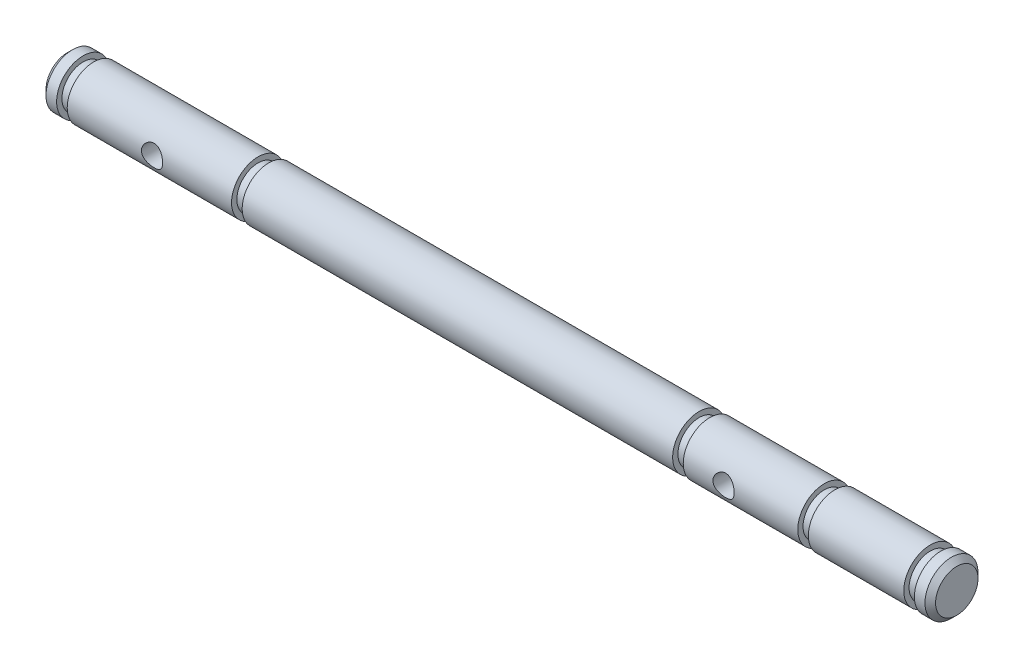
ISO-10303-21;
HEADER;
FILE_DESCRIPTION(('STEP AP214'),'2;1');
FILE_NAME('part.step','',(''),(''),'','','');
FILE_SCHEMA(('AUTOMOTIVE_DESIGN { 1 0 10303 214 1 1 1 1 }'));
ENDSEC;
DATA;
#1=APPLICATION_CONTEXT('core data for automotive mechanical design processes');
#2=APPLICATION_PROTOCOL_DEFINITION('international standard','automotive_design',2000,#1);
#3=PRODUCT_CONTEXT('',#1,'mechanical');
#4=PRODUCT('Part','Part','',(#3));
#5=PRODUCT_RELATED_PRODUCT_CATEGORY('part','',(#4));
#6=PRODUCT_DEFINITION_FORMATION('','',#4);
#7=PRODUCT_DEFINITION_CONTEXT('part definition',#1,'design');
#8=PRODUCT_DEFINITION('design','',#6,#7);
#9=PRODUCT_DEFINITION_SHAPE('','',#8);
#10=(LENGTH_UNIT() NAMED_UNIT(*) SI_UNIT(.MILLI.,.METRE.));
#11=(NAMED_UNIT(*) PLANE_ANGLE_UNIT() SI_UNIT($,.RADIAN.));
#12=(NAMED_UNIT(*) SI_UNIT($,.STERADIAN.) SOLID_ANGLE_UNIT());
#13=UNCERTAINTY_MEASURE_WITH_UNIT(LENGTH_MEASURE(1.E-05),#10,'distance_accuracy_value','');
#14=(GEOMETRIC_REPRESENTATION_CONTEXT(3) GLOBAL_UNCERTAINTY_ASSIGNED_CONTEXT((#13)) GLOBAL_UNIT_ASSIGNED_CONTEXT((#10,
#11,#12)) REPRESENTATION_CONTEXT('',''));
#15=CARTESIAN_POINT('',(0.,0.,0.));
#16=DIRECTION('',(0.,0.,1.));
#17=DIRECTION('',(1.,0.,0.));
#18=AXIS2_PLACEMENT_3D('',#15,#16,#17);
#19=CARTESIAN_POINT('',(0.,0.,0.));
#20=DIRECTION('',(1.,0.,0.));
#21=DIRECTION('',(0.,0.,-1.));
#22=AXIS2_PLACEMENT_3D('',#19,#20,#21);
#23=PLANE('',#22);
#24=CARTESIAN_POINT('',(0.,0.,0.));
#25=DIRECTION('',(1.,0.,0.));
#26=DIRECTION('',(0.,0.,-1.));
#27=AXIS2_PLACEMENT_3D('',#24,#25,#26);
#28=CIRCLE('',#27,2.);
#29=CARTESIAN_POINT('',(0.,0.,-2.));
#30=VERTEX_POINT('',#29);
#31=EDGE_CURVE('E456',#30,#30,#28,.F.);
#32=ORIENTED_EDGE('',*,*,#31,.T.);
#33=EDGE_LOOP('',(#32));
#34=FACE_BOUND('',#33,.T.);
#35=ADVANCED_FACE('F360',(#34),#23,.F.);
#36=CARTESIAN_POINT('',(-4.72932200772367,0.,0.));
#37=DIRECTION('',(-1.,0.,0.));
#38=DIRECTION('',(0.,0.,1.));
#39=AXIS2_PLACEMENT_3D('',#36,#37,#38);
#40=CYLINDRICAL_SURFACE('',#39,2.5);
#41=CARTESIAN_POINT('',(0.500000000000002,0.,0.));
#42=DIRECTION('',(1.,0.,0.));
#43=DIRECTION('',(0.,0.,-1.));
#44=AXIS2_PLACEMENT_3D('',#41,#42,#43);
#45=CIRCLE('',#44,2.5);
#46=CARTESIAN_POINT('',(0.500000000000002,0.,-2.5));
#47=VERTEX_POINT('',#46);
#48=EDGE_CURVE('E408',#47,#47,#45,.T.);
#49=ORIENTED_EDGE('',*,*,#48,.T.);
#50=EDGE_LOOP('',(#49));
#51=FACE_BOUND('',#50,.T.);
#52=CARTESIAN_POINT('',(1.5,0.,0.));
#53=DIRECTION('',(-1.,0.,0.));
#54=DIRECTION('',(0.,0.,1.));
#55=AXIS2_PLACEMENT_3D('',#52,#53,#54);
#56=CIRCLE('',#55,2.5);
#57=CARTESIAN_POINT('',(1.5,0.,2.5));
#58=VERTEX_POINT('',#57);
#59=EDGE_CURVE('E443',#58,#58,#56,.T.);
#60=ORIENTED_EDGE('',*,*,#59,.T.);
#61=EDGE_LOOP('',(#60));
#62=FACE_BOUND('',#61,.T.);
#63=ADVANCED_FACE('F429',(#51,#62),#40,.T.);
#64=CARTESIAN_POINT('',(1.5,2.5,0.));
#65=DIRECTION('',(-1.,0.,0.));
#66=DIRECTION('',(0.,0.,1.));
#67=AXIS2_PLACEMENT_3D('',#64,#65,#66);
#68=PLANE('',#67);
#69=ORIENTED_EDGE('',*,*,#59,.F.);
#70=EDGE_LOOP('',(#69));
#71=FACE_BOUND('',#70,.T.);
#72=CARTESIAN_POINT('',(1.5,0.,0.));
#73=DIRECTION('',(-1.,0.,0.));
#74=DIRECTION('',(0.,0.,1.));
#75=AXIS2_PLACEMENT_3D('',#72,#73,#74);
#76=CIRCLE('',#75,2.);
#77=CARTESIAN_POINT('',(1.5,0.,2.));
#78=VERTEX_POINT('',#77);
#79=EDGE_CURVE('E445',#78,#78,#76,.T.);
#80=ORIENTED_EDGE('',*,*,#79,.T.);
#81=EDGE_LOOP('',(#80));
#82=FACE_BOUND('',#81,.T.);
#83=ADVANCED_FACE('F426',(#71,#82),#68,.F.);
#84=CARTESIAN_POINT('',(-4.72932200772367,0.,0.));
#85=DIRECTION('',(-1.,0.,0.));
#86=DIRECTION('',(0.,0.,1.));
#87=AXIS2_PLACEMENT_3D('',#84,#85,#86);
#88=CYLINDRICAL_SURFACE('',#87,2.);
#89=ORIENTED_EDGE('',*,*,#79,.F.);
#90=EDGE_LOOP('',(#89));
#91=FACE_BOUND('',#90,.T.);
#92=CARTESIAN_POINT('',(2.5,0.,0.));
#93=DIRECTION('',(-1.,0.,0.));
#94=DIRECTION('',(0.,0.,1.));
#95=AXIS2_PLACEMENT_3D('',#92,#93,#94);
#96=CIRCLE('',#95,2.);
#97=CARTESIAN_POINT('',(2.5,0.,2.));
#98=VERTEX_POINT('',#97);
#99=EDGE_CURVE('E451',#98,#98,#96,.T.);
#100=ORIENTED_EDGE('',*,*,#99,.T.);
#101=EDGE_LOOP('',(#100));
#102=FACE_BOUND('',#101,.T.);
#103=ADVANCED_FACE('F422',(#91,#102),#88,.T.);
#104=CARTESIAN_POINT('',(2.5,2.5,0.));
#105=DIRECTION('',(1.,0.,0.));
#106=DIRECTION('',(0.,0.,-1.));
#107=AXIS2_PLACEMENT_3D('',#104,#105,#106);
#108=PLANE('',#107);
#109=ORIENTED_EDGE('',*,*,#99,.F.);
#110=EDGE_LOOP('',(#109));
#111=FACE_BOUND('',#110,.T.);
#112=CARTESIAN_POINT('',(2.5,0.,0.));
#113=DIRECTION('',(-1.,0.,0.));
#114=DIRECTION('',(0.,0.,1.));
#115=AXIS2_PLACEMENT_3D('',#112,#113,#114);
#116=CIRCLE('',#115,2.5);
#117=CARTESIAN_POINT('',(2.5,0.,2.5));
#118=VERTEX_POINT('',#117);
#119=EDGE_CURVE('E549',#118,#118,#116,.T.);
#120=ORIENTED_EDGE('',*,*,#119,.T.);
#121=EDGE_LOOP('',(#120));
#122=FACE_BOUND('',#121,.T.);
#123=ADVANCED_FACE('F416',(#111,#122),#108,.F.);
#124=CARTESIAN_POINT('',(-4.72932200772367,0.,0.));
#125=DIRECTION('',(-1.,0.,0.));
#126=DIRECTION('',(0.,0.,1.));
#127=AXIS2_PLACEMENT_3D('',#124,#125,#126);
#128=CYLINDRICAL_SURFACE('',#127,2.5);
#129=CARTESIAN_POINT('',(11.5,0.,-2.5));
#130=CARTESIAN_POINT('',(11.4999950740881,0.0537465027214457,-2.49999635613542));
#131=CARTESIAN_POINT('',(11.4956411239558,0.107586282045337,-2.49824647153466));
#132=CARTESIAN_POINT('',(11.4783761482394,0.213748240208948,-2.49141726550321));
#133=CARTESIAN_POINT('',(11.4654418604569,0.266065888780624,-2.48632889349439));
#134=CARTESIAN_POINT('',(11.4315619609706,0.367476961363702,-2.47337104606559));
#135=CARTESIAN_POINT('',(11.4106425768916,0.41658033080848,-2.46551068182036));
#136=CARTESIAN_POINT('',(11.3614904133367,0.510535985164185,-2.44778305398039));
#137=CARTESIAN_POINT('',(11.3332601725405,0.555389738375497,-2.43791648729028));
#138=CARTESIAN_POINT('',(11.2688822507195,0.641750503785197,-2.41665443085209));
#139=CARTESIAN_POINT('',(11.2324466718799,0.683031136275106,-2.40521148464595));
#140=CARTESIAN_POINT('',(11.1532999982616,0.759087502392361,-2.38230288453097));
#141=CARTESIAN_POINT('',(11.1105858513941,0.793860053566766,-2.37083722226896));
#142=CARTESIAN_POINT('',(11.0177859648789,0.857437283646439,-2.34861395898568));
#143=CARTESIAN_POINT('',(10.9674567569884,0.885907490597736,-2.33791057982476));
#144=CARTESIAN_POINT('',(10.86223180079,0.933877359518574,-2.31916823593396));
#145=CARTESIAN_POINT('',(10.8073382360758,0.953381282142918,-2.31112800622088));
#146=CARTESIAN_POINT('',(10.697143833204,0.981949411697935,-2.29913178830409));
#147=CARTESIAN_POINT('',(10.6419743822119,0.991446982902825,-2.29500710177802));
#148=CARTESIAN_POINT('',(10.5306825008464,1.00108648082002,-2.29082002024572));
#149=CARTESIAN_POINT('',(10.4745605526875,1.00123300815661,-2.29075562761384));
#150=CARTESIAN_POINT('',(10.367121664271,0.992494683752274,-2.29455250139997));
#151=CARTESIAN_POINT('',(10.3157421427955,0.98423765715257,-2.29814087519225));
#152=CARTESIAN_POINT('',(10.2151702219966,0.959973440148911,-2.30838093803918));
#153=CARTESIAN_POINT('',(10.1659782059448,0.943964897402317,-2.31503316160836));
#154=CARTESIAN_POINT('',(10.069991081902,0.904347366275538,-2.33079742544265));
#155=CARTESIAN_POINT('',(10.0232653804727,0.88058993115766,-2.33995689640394));
#156=CARTESIAN_POINT('',(9.93429209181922,0.826253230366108,-2.35969058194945));
#157=CARTESIAN_POINT('',(9.8920461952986,0.795671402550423,-2.37026532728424));
#158=CARTESIAN_POINT('',(9.809795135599,0.725775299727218,-2.39263368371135));
#159=CARTESIAN_POINT('',(9.77021563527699,0.685968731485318,-2.40445832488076));
#160=CARTESIAN_POINT('',(9.69815776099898,0.600157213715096,-2.42729912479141));
#161=CARTESIAN_POINT('',(9.66568080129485,0.554151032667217,-2.43831512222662));
#162=CARTESIAN_POINT('',(9.60819127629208,0.456038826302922,-2.45857340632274));
#163=CARTESIAN_POINT('',(9.58333885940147,0.403830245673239,-2.46777635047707));
#164=CARTESIAN_POINT('',(9.54291606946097,0.295511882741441,-2.48307414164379));
#165=CARTESIAN_POINT('',(9.52734098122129,0.239404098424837,-2.48917056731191));
#166=CARTESIAN_POINT('',(9.50677585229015,0.12844794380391,-2.49728069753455));
#167=CARTESIAN_POINT('',(9.50121377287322,0.0737216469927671,-2.49951472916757));
#168=CARTESIAN_POINT('',(9.49914344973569,-0.0359226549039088,-2.50034239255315));
#169=CARTESIAN_POINT('',(9.50263285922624,-0.090840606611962,-2.49893696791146));
#170=CARTESIAN_POINT('',(9.51814587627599,-0.196716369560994,-2.49278783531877));
#171=CARTESIAN_POINT('',(9.52977899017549,-0.247741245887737,-2.48819695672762));
#172=CARTESIAN_POINT('',(9.56071785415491,-0.34706771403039,-2.4762972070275));
#173=CARTESIAN_POINT('',(9.58002458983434,-0.395368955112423,-2.46898798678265));
#174=CARTESIAN_POINT('',(9.62639246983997,-0.489539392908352,-2.45208297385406));
#175=CARTESIAN_POINT('',(9.65367273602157,-0.535289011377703,-2.44242407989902));
#176=CARTESIAN_POINT('',(9.71497016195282,-0.621721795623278,-2.42186682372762));
#177=CARTESIAN_POINT('',(9.74899002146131,-0.662402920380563,-2.41096796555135));
#178=CARTESIAN_POINT('',(9.82543500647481,-0.740361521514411,-2.38822558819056));
#179=CARTESIAN_POINT('',(9.8682667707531,-0.777236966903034,-2.37636720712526));
#180=CARTESIAN_POINT('',(9.95972004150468,-0.843375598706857,-2.35370836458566));
#181=CARTESIAN_POINT('',(10.00834250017,-0.872637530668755,-2.34290807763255));
#182=CARTESIAN_POINT('',(10.1107308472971,-0.922903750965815,-2.32357149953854));
#183=CARTESIAN_POINT('',(10.1645419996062,-0.943825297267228,-2.31505815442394));
#184=CARTESIAN_POINT('',(10.2753668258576,-0.976148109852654,-2.30161836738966));
#185=CARTESIAN_POINT('',(10.3323781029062,-0.987556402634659,-2.29668927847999));
#186=CARTESIAN_POINT('',(10.4435639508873,-0.999857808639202,-2.29135879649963));
#187=CARTESIAN_POINT('',(10.4976474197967,-1.00144854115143,-2.29065710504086));
#188=CARTESIAN_POINT('',(10.6052724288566,-0.995901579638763,-2.29307418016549));
#189=CARTESIAN_POINT('',(10.6588140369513,-0.988764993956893,-2.29619246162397));
#190=CARTESIAN_POINT('',(10.7616660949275,-0.966535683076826,-2.3056332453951));
#191=CARTESIAN_POINT('',(10.8110601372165,-0.95176874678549,-2.31182415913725));
#192=CARTESIAN_POINT('',(10.9066893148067,-0.915002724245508,-2.32662000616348));
#193=CARTESIAN_POINT('',(10.9529235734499,-0.893001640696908,-2.33522560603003));
#194=CARTESIAN_POINT('',(11.0438048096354,-0.840936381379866,-2.35449304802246));
#195=CARTESIAN_POINT('',(11.0882093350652,-0.810482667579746,-2.36524441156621));
#196=CARTESIAN_POINT('',(11.1714966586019,-0.742946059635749,-2.38731902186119));
#197=CARTESIAN_POINT('',(11.2103777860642,-0.705861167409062,-2.39864244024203));
#198=CARTESIAN_POINT('',(11.2841014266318,-0.623252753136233,-2.42146783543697));
#199=CARTESIAN_POINT('',(11.318518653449,-0.577338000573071,-2.43293378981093));
#200=CARTESIAN_POINT('',(11.3791685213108,-0.47995016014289,-2.45400203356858));
#201=CARTESIAN_POINT('',(11.4053973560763,-0.428474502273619,-2.46360345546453));
#202=CARTESIAN_POINT('',(11.4483111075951,-0.322369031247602,-2.47969857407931));
#203=CARTESIAN_POINT('',(11.4651646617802,-0.267815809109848,-2.48624681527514));
#204=CARTESIAN_POINT('',(11.4893195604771,-0.156438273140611,-2.49572153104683));
#205=CARTESIAN_POINT('',(11.496651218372,-0.0996217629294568,-2.49865949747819));
#206=CARTESIAN_POINT('',(11.4996976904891,-0.0284561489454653,-2.49987949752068));
#207=CARTESIAN_POINT('',(11.5000013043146,-0.0142313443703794,-2.50000096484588));
#208=CARTESIAN_POINT('',(11.5,0.,-2.5));
#209=B_SPLINE_CURVE_WITH_KNOTS('',3,(#129,#130,#131,#132,#133,#134,#135,#136,#137,#138,#139,
#140,#141,#142,#143,#144,#145,#146,#147,#148,#149,#150,#151,#152,#153,#154,#155,#156,#157,#158,
#159,#160,#161,#162,#163,#164,#165,#166,#167,#168,#169,#170,#171,#172,#173,#174,#175,#176,#177,
#178,#179,#180,#181,#182,#183,#184,#185,#186,#187,#188,#189,#190,#191,#192,#193,#194,#195,#196,
#197,#198,#199,#200,#201,#202,#203,#204,#205,#206,#207,#208),.UNSPECIFIED.,.T.,.F.,(4,2,2,2,2,2,
2,2,2,2,2,2,2,2,2,2,2,2,2,2,2,2,2,2,2,2,2,2,2,2,2,2,2,2,2,2,2,2,2,4),(0.,0.161201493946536,
0.322841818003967,0.483955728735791,0.645013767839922,0.812986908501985,0.981041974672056,
1.15657629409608,1.33202711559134,1.49952052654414,1.66693153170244,1.82269164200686,
1.97847893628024,2.13744563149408,2.29647210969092,2.46779174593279,2.63914546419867,
2.81388456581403,2.98853478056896,3.15284592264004,3.31711446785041,3.47400227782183,
3.63091024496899,3.79261756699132,3.95438979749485,4.12684237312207,4.29932334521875,
4.47347522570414,4.64749836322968,4.80899836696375,4.97047786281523,5.12557159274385,
5.28070817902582,5.44472734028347,5.60879600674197,5.78350211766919,5.95828931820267,
6.1298215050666,6.30080626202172,6.34349022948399),.UNSPECIFIED.);
#210=CARTESIAN_POINT('',(11.5,0.,-2.5));
#211=VERTEX_POINT('',#210);
#212=EDGE_CURVE('E374',#211,#211,#209,.T.);
#213=ORIENTED_EDGE('',*,*,#212,.T.);
#214=EDGE_LOOP('',(#213));
#215=FACE_BOUND('',#214,.T.);
#216=CARTESIAN_POINT('',(11.5,0.,2.5));
#217=CARTESIAN_POINT('',(11.4999950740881,-0.0537465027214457,2.49999635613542));
#218=CARTESIAN_POINT('',(11.4956411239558,-0.107586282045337,2.49824647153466));
#219=CARTESIAN_POINT('',(11.4783761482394,-0.213748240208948,2.49141726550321));
#220=CARTESIAN_POINT('',(11.4654418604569,-0.266065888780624,2.48632889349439));
#221=CARTESIAN_POINT('',(11.4315619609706,-0.367476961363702,2.47337104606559));
#222=CARTESIAN_POINT('',(11.4106425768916,-0.41658033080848,2.46551068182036));
#223=CARTESIAN_POINT('',(11.3614904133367,-0.510535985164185,2.44778305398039));
#224=CARTESIAN_POINT('',(11.3332601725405,-0.555389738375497,2.43791648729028));
#225=CARTESIAN_POINT('',(11.2688822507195,-0.641750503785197,2.41665443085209));
#226=CARTESIAN_POINT('',(11.2324466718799,-0.683031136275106,2.40521148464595));
#227=CARTESIAN_POINT('',(11.1532999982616,-0.759087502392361,2.38230288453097));
#228=CARTESIAN_POINT('',(11.1105858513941,-0.793860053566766,2.37083722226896));
#229=CARTESIAN_POINT('',(11.0177859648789,-0.857437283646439,2.34861395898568));
#230=CARTESIAN_POINT('',(10.9674567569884,-0.885907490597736,2.33791057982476));
#231=CARTESIAN_POINT('',(10.86223180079,-0.933877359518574,2.31916823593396));
#232=CARTESIAN_POINT('',(10.8073382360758,-0.953381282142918,2.31112800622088));
#233=CARTESIAN_POINT('',(10.697143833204,-0.981949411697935,2.29913178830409));
#234=CARTESIAN_POINT('',(10.6419743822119,-0.991446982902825,2.29500710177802));
#235=CARTESIAN_POINT('',(10.5306825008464,-1.00108648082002,2.29082002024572));
#236=CARTESIAN_POINT('',(10.4745605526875,-1.00123300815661,2.29075562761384));
#237=CARTESIAN_POINT('',(10.367121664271,-0.992494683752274,2.29455250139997));
#238=CARTESIAN_POINT('',(10.3157421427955,-0.98423765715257,2.29814087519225));
#239=CARTESIAN_POINT('',(10.2151702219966,-0.959973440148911,2.30838093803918));
#240=CARTESIAN_POINT('',(10.1659782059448,-0.943964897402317,2.31503316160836));
#241=CARTESIAN_POINT('',(10.069991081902,-0.904347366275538,2.33079742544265));
#242=CARTESIAN_POINT('',(10.0232653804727,-0.88058993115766,2.33995689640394));
#243=CARTESIAN_POINT('',(9.93429209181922,-0.826253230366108,2.35969058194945));
#244=CARTESIAN_POINT('',(9.8920461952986,-0.795671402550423,2.37026532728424));
#245=CARTESIAN_POINT('',(9.809795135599,-0.725775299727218,2.39263368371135));
#246=CARTESIAN_POINT('',(9.77021563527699,-0.685968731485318,2.40445832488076));
#247=CARTESIAN_POINT('',(9.69815776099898,-0.600157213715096,2.42729912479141));
#248=CARTESIAN_POINT('',(9.66568080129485,-0.554151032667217,2.43831512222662));
#249=CARTESIAN_POINT('',(9.60819127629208,-0.456038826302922,2.45857340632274));
#250=CARTESIAN_POINT('',(9.58333885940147,-0.403830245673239,2.46777635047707));
#251=CARTESIAN_POINT('',(9.54291606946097,-0.295511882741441,2.48307414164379));
#252=CARTESIAN_POINT('',(9.52734098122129,-0.239404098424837,2.48917056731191));
#253=CARTESIAN_POINT('',(9.50677585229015,-0.12844794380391,2.49728069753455));
#254=CARTESIAN_POINT('',(9.50121377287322,-0.0737216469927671,2.49951472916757));
#255=CARTESIAN_POINT('',(9.49914344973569,0.0359226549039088,2.50034239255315));
#256=CARTESIAN_POINT('',(9.50263285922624,0.090840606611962,2.49893696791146));
#257=CARTESIAN_POINT('',(9.51814587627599,0.196716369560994,2.49278783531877));
#258=CARTESIAN_POINT('',(9.52977899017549,0.247741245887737,2.48819695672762));
#259=CARTESIAN_POINT('',(9.56071785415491,0.34706771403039,2.4762972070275));
#260=CARTESIAN_POINT('',(9.58002458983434,0.395368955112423,2.46898798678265));
#261=CARTESIAN_POINT('',(9.62639246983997,0.489539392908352,2.45208297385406));
#262=CARTESIAN_POINT('',(9.65367273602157,0.535289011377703,2.44242407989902));
#263=CARTESIAN_POINT('',(9.71497016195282,0.621721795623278,2.42186682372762));
#264=CARTESIAN_POINT('',(9.74899002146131,0.662402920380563,2.41096796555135));
#265=CARTESIAN_POINT('',(9.82543500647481,0.740361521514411,2.38822558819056));
#266=CARTESIAN_POINT('',(9.8682667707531,0.777236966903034,2.37636720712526));
#267=CARTESIAN_POINT('',(9.95972004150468,0.843375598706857,2.35370836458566));
#268=CARTESIAN_POINT('',(10.00834250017,0.872637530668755,2.34290807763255));
#269=CARTESIAN_POINT('',(10.1107308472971,0.922903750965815,2.32357149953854));
#270=CARTESIAN_POINT('',(10.1645419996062,0.943825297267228,2.31505815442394));
#271=CARTESIAN_POINT('',(10.2753668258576,0.976148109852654,2.30161836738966));
#272=CARTESIAN_POINT('',(10.3323781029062,0.987556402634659,2.29668927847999));
#273=CARTESIAN_POINT('',(10.4435639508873,0.999857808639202,2.29135879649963));
#274=CARTESIAN_POINT('',(10.4976474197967,1.00144854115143,2.29065710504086));
#275=CARTESIAN_POINT('',(10.6052724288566,0.995901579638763,2.29307418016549));
#276=CARTESIAN_POINT('',(10.6588140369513,0.988764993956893,2.29619246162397));
#277=CARTESIAN_POINT('',(10.7616660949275,0.966535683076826,2.3056332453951));
#278=CARTESIAN_POINT('',(10.8110601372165,0.95176874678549,2.31182415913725));
#279=CARTESIAN_POINT('',(10.9066893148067,0.915002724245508,2.32662000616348));
#280=CARTESIAN_POINT('',(10.9529235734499,0.893001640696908,2.33522560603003));
#281=CARTESIAN_POINT('',(11.0438048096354,0.840936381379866,2.35449304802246));
#282=CARTESIAN_POINT('',(11.0882093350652,0.810482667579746,2.36524441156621));
#283=CARTESIAN_POINT('',(11.1714966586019,0.742946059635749,2.38731902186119));
#284=CARTESIAN_POINT('',(11.2103777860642,0.705861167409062,2.39864244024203));
#285=CARTESIAN_POINT('',(11.2841014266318,0.623252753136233,2.42146783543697));
#286=CARTESIAN_POINT('',(11.318518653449,0.577338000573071,2.43293378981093));
#287=CARTESIAN_POINT('',(11.3791685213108,0.47995016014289,2.45400203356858));
#288=CARTESIAN_POINT('',(11.4053973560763,0.428474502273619,2.46360345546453));
#289=CARTESIAN_POINT('',(11.4483111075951,0.322369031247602,2.47969857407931));
#290=CARTESIAN_POINT('',(11.4651646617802,0.267815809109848,2.48624681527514));
#291=CARTESIAN_POINT('',(11.4893195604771,0.156438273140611,2.49572153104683));
#292=CARTESIAN_POINT('',(11.496651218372,0.0996217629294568,2.49865949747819));
#293=CARTESIAN_POINT('',(11.4996976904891,0.0284561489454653,2.49987949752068));
#294=CARTESIAN_POINT('',(11.5000013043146,0.0142313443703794,2.50000096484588));
#295=CARTESIAN_POINT('',(11.5,0.,2.5));
#296=B_SPLINE_CURVE_WITH_KNOTS('',3,(#216,#217,#218,#219,#220,#221,#222,#223,#224,#225,#226,
#227,#228,#229,#230,#231,#232,#233,#234,#235,#236,#237,#238,#239,#240,#241,#242,#243,#244,#245,
#246,#247,#248,#249,#250,#251,#252,#253,#254,#255,#256,#257,#258,#259,#260,#261,#262,#263,#264,
#265,#266,#267,#268,#269,#270,#271,#272,#273,#274,#275,#276,#277,#278,#279,#280,#281,#282,#283,
#284,#285,#286,#287,#288,#289,#290,#291,#292,#293,#294,#295),.UNSPECIFIED.,.T.,.F.,(4,2,2,2,2,2,
2,2,2,2,2,2,2,2,2,2,2,2,2,2,2,2,2,2,2,2,2,2,2,2,2,2,2,2,2,2,2,2,2,4),(0.,0.161201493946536,
0.322841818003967,0.483955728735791,0.645013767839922,0.812986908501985,0.981041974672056,
1.15657629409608,1.33202711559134,1.49952052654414,1.66693153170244,1.82269164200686,
1.97847893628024,2.13744563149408,2.29647210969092,2.46779174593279,2.63914546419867,
2.81388456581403,2.98853478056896,3.15284592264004,3.31711446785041,3.47400227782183,
3.63091024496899,3.79261756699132,3.95438979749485,4.12684237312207,4.29932334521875,
4.47347522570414,4.64749836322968,4.80899836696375,4.97047786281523,5.12557159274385,
5.28070817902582,5.44472734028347,5.60879600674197,5.78350211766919,5.95828931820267,
6.1298215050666,6.30080626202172,6.34349022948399),.UNSPECIFIED.);
#297=CARTESIAN_POINT('',(11.5,0.,2.5));
#298=VERTEX_POINT('',#297);
#299=EDGE_CURVE('E378',#298,#298,#296,.T.);
#300=ORIENTED_EDGE('',*,*,#299,.T.);
#301=EDGE_LOOP('',(#300));
#302=FACE_BOUND('',#301,.T.);
#303=ORIENTED_EDGE('',*,*,#119,.F.);
#304=EDGE_LOOP('',(#303));
#305=FACE_BOUND('',#304,.T.);
#306=CARTESIAN_POINT('',(18.,0.,0.));
#307=DIRECTION('',(-1.,0.,0.));
#308=DIRECTION('',(0.,0.,1.));
#309=AXIS2_PLACEMENT_3D('',#306,#307,#308);
#310=CIRCLE('',#309,2.5);
#311=CARTESIAN_POINT('',(18.,0.,2.5));
#312=VERTEX_POINT('',#311);
#313=EDGE_CURVE('E546',#312,#312,#310,.T.);
#314=ORIENTED_EDGE('',*,*,#313,.T.);
#315=EDGE_LOOP('',(#314));
#316=FACE_BOUND('',#315,.T.);
#317=ADVANCED_FACE('F410',(#215,#302,#305,#316),#128,.T.);
#318=CARTESIAN_POINT('',(18.,2.5,0.));
#319=DIRECTION('',(-1.,0.,0.));
#320=DIRECTION('',(0.,0.,1.));
#321=AXIS2_PLACEMENT_3D('',#318,#319,#320);
#322=PLANE('',#321);
#323=ORIENTED_EDGE('',*,*,#313,.F.);
#324=EDGE_LOOP('',(#323));
#325=FACE_BOUND('',#324,.T.);
#326=CARTESIAN_POINT('',(18.,0.,0.));
#327=DIRECTION('',(-1.,0.,0.));
#328=DIRECTION('',(0.,0.,1.));
#329=AXIS2_PLACEMENT_3D('',#326,#327,#328);
#330=CIRCLE('',#329,2.);
#331=CARTESIAN_POINT('',(18.,0.,2.));
#332=VERTEX_POINT('',#331);
#333=EDGE_CURVE('E543',#332,#332,#330,.T.);
#334=ORIENTED_EDGE('',*,*,#333,.T.);
#335=EDGE_LOOP('',(#334));
#336=FACE_BOUND('',#335,.T.);
#337=ADVANCED_FACE('F415',(#325,#336),#322,.F.);
#338=CARTESIAN_POINT('',(-4.72932200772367,0.,0.));
#339=DIRECTION('',(-1.,0.,0.));
#340=DIRECTION('',(0.,0.,1.));
#341=AXIS2_PLACEMENT_3D('',#338,#339,#340);
#342=CYLINDRICAL_SURFACE('',#341,2.);
#343=ORIENTED_EDGE('',*,*,#333,.F.);
#344=EDGE_LOOP('',(#343));
#345=FACE_BOUND('',#344,.T.);
#346=CARTESIAN_POINT('',(19.,0.,0.));
#347=DIRECTION('',(-1.,0.,0.));
#348=DIRECTION('',(0.,0.,1.));
#349=AXIS2_PLACEMENT_3D('',#346,#347,#348);
#350=CIRCLE('',#349,2.);
#351=CARTESIAN_POINT('',(19.,0.,2.));
#352=VERTEX_POINT('',#351);
#353=EDGE_CURVE('E540',#352,#352,#350,.T.);
#354=ORIENTED_EDGE('',*,*,#353,.T.);
#355=EDGE_LOOP('',(#354));
#356=FACE_BOUND('',#355,.T.);
#357=ADVANCED_FACE('F562',(#345,#356),#342,.T.);
#358=CARTESIAN_POINT('',(19.,2.5,0.));
#359=DIRECTION('',(1.,0.,0.));
#360=DIRECTION('',(0.,0.,-1.));
#361=AXIS2_PLACEMENT_3D('',#358,#359,#360);
#362=PLANE('',#361);
#363=ORIENTED_EDGE('',*,*,#353,.F.);
#364=EDGE_LOOP('',(#363));
#365=FACE_BOUND('',#364,.T.);
#366=CARTESIAN_POINT('',(19.,0.,0.));
#367=DIRECTION('',(-1.,0.,0.));
#368=DIRECTION('',(0.,0.,1.));
#369=AXIS2_PLACEMENT_3D('',#366,#367,#368);
#370=CIRCLE('',#369,2.5);
#371=CARTESIAN_POINT('',(19.,0.,2.5));
#372=VERTEX_POINT('',#371);
#373=EDGE_CURVE('E537',#372,#372,#370,.T.);
#374=ORIENTED_EDGE('',*,*,#373,.T.);
#375=EDGE_LOOP('',(#374));
#376=FACE_BOUND('',#375,.T.);
#377=ADVANCED_FACE('F567',(#365,#376),#362,.F.);
#378=CARTESIAN_POINT('',(-4.72932200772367,0.,0.));
#379=DIRECTION('',(-1.,0.,0.));
#380=DIRECTION('',(0.,0.,1.));
#381=AXIS2_PLACEMENT_3D('',#378,#379,#380);
#382=CYLINDRICAL_SURFACE('',#381,2.5);
#383=ORIENTED_EDGE('',*,*,#373,.F.);
#384=EDGE_LOOP('',(#383));
#385=FACE_BOUND('',#384,.T.);
#386=CARTESIAN_POINT('',(59.6,0.,0.));
#387=DIRECTION('',(-1.,0.,0.));
#388=DIRECTION('',(0.,0.,1.));
#389=AXIS2_PLACEMENT_3D('',#386,#387,#388);
#390=CIRCLE('',#389,2.5);
#391=CARTESIAN_POINT('',(59.6,0.,2.5));
#392=VERTEX_POINT('',#391);
#393=EDGE_CURVE('E534',#392,#392,#390,.T.);
#394=ORIENTED_EDGE('',*,*,#393,.T.);
#395=EDGE_LOOP('',(#394));
#396=FACE_BOUND('',#395,.T.);
#397=ADVANCED_FACE('F572',(#385,#396),#382,.T.);
#398=CARTESIAN_POINT('',(59.6,2.5,0.));
#399=DIRECTION('',(-1.,0.,0.));
#400=DIRECTION('',(0.,0.,1.));
#401=AXIS2_PLACEMENT_3D('',#398,#399,#400);
#402=PLANE('',#401);
#403=ORIENTED_EDGE('',*,*,#393,.F.);
#404=EDGE_LOOP('',(#403));
#405=FACE_BOUND('',#404,.T.);
#406=CARTESIAN_POINT('',(59.6,0.,0.));
#407=DIRECTION('',(-1.,0.,0.));
#408=DIRECTION('',(0.,0.,1.));
#409=AXIS2_PLACEMENT_3D('',#406,#407,#408);
#410=CIRCLE('',#409,2.);
#411=CARTESIAN_POINT('',(59.6,0.,2.));
#412=VERTEX_POINT('',#411);
#413=EDGE_CURVE('E531',#412,#412,#410,.T.);
#414=ORIENTED_EDGE('',*,*,#413,.T.);
#415=EDGE_LOOP('',(#414));
#416=FACE_BOUND('',#415,.T.);
#417=ADVANCED_FACE('F578',(#405,#416),#402,.F.);
#418=CARTESIAN_POINT('',(-4.72932200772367,0.,0.));
#419=DIRECTION('',(-1.,0.,0.));
#420=DIRECTION('',(0.,0.,1.));
#421=AXIS2_PLACEMENT_3D('',#418,#419,#420);
#422=CYLINDRICAL_SURFACE('',#421,2.);
#423=ORIENTED_EDGE('',*,*,#413,.F.);
#424=EDGE_LOOP('',(#423));
#425=FACE_BOUND('',#424,.T.);
#426=CARTESIAN_POINT('',(60.6,0.,0.));
#427=DIRECTION('',(-1.,0.,0.));
#428=DIRECTION('',(0.,0.,1.));
#429=AXIS2_PLACEMENT_3D('',#426,#427,#428);
#430=CIRCLE('',#429,2.);
#431=CARTESIAN_POINT('',(60.6,0.,2.));
#432=VERTEX_POINT('',#431);
#433=EDGE_CURVE('E528',#432,#432,#430,.T.);
#434=ORIENTED_EDGE('',*,*,#433,.T.);
#435=EDGE_LOOP('',(#434));
#436=FACE_BOUND('',#435,.T.);
#437=ADVANCED_FACE('F584',(#425,#436),#422,.T.);
#438=CARTESIAN_POINT('',(60.6,2.5,0.));
#439=DIRECTION('',(1.,0.,0.));
#440=DIRECTION('',(0.,0.,-1.));
#441=AXIS2_PLACEMENT_3D('',#438,#439,#440);
#442=PLANE('',#441);
#443=ORIENTED_EDGE('',*,*,#433,.F.);
#444=EDGE_LOOP('',(#443));
#445=FACE_BOUND('',#444,.T.);
#446=CARTESIAN_POINT('',(60.6,0.,0.));
#447=DIRECTION('',(-1.,0.,0.));
#448=DIRECTION('',(0.,0.,1.));
#449=AXIS2_PLACEMENT_3D('',#446,#447,#448);
#450=CIRCLE('',#449,2.5);
#451=CARTESIAN_POINT('',(60.6,0.,2.5));
#452=VERTEX_POINT('',#451);
#453=EDGE_CURVE('E519',#452,#452,#450,.T.);
#454=ORIENTED_EDGE('',*,*,#453,.T.);
#455=EDGE_LOOP('',(#454));
#456=FACE_BOUND('',#455,.T.);
#457=ADVANCED_FACE('F509',(#445,#456),#442,.F.);
#458=CARTESIAN_POINT('',(-4.72932200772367,0.,0.));
#459=DIRECTION('',(-1.,0.,0.));
#460=DIRECTION('',(0.,0.,1.));
#461=AXIS2_PLACEMENT_3D('',#458,#459,#460);
#462=CYLINDRICAL_SURFACE('',#461,2.5);
#463=CARTESIAN_POINT('',(65.4,0.,-2.5));
#464=CARTESIAN_POINT('',(65.3999950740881,0.0537465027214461,-2.49999635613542));
#465=CARTESIAN_POINT('',(65.3956411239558,0.107586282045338,-2.49824647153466));
#466=CARTESIAN_POINT('',(65.3783761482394,0.213748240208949,-2.49141726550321));
#467=CARTESIAN_POINT('',(65.3654418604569,0.266065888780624,-2.48632889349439));
#468=CARTESIAN_POINT('',(65.3315619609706,0.367476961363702,-2.47337104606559));
#469=CARTESIAN_POINT('',(65.3106425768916,0.416580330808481,-2.46551068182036));
#470=CARTESIAN_POINT('',(65.2614904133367,0.510535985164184,-2.44778305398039));
#471=CARTESIAN_POINT('',(65.2332601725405,0.555389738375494,-2.43791648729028));
#472=CARTESIAN_POINT('',(65.1688822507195,0.641750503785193,-2.41665443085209));
#473=CARTESIAN_POINT('',(65.1324466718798,0.683031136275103,-2.40521148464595));
#474=CARTESIAN_POINT('',(65.0532999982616,0.759087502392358,-2.38230288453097));
#475=CARTESIAN_POINT('',(65.0105858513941,0.793860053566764,-2.37083722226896));
#476=CARTESIAN_POINT('',(64.9177859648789,0.857437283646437,-2.34861395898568));
#477=CARTESIAN_POINT('',(64.8674567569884,0.885907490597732,-2.33791057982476));
#478=CARTESIAN_POINT('',(64.76223180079,0.933877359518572,-2.31916823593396));
#479=CARTESIAN_POINT('',(64.7073382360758,0.953381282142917,-2.31112800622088));
#480=CARTESIAN_POINT('',(64.5971438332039,0.981949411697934,-2.29913178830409));
#481=CARTESIAN_POINT('',(64.5419743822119,0.991446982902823,-2.29500710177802));
#482=CARTESIAN_POINT('',(64.4306825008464,1.00108648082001,-2.29082002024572));
#483=CARTESIAN_POINT('',(64.3745605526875,1.00123300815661,-2.29075562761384));
#484=CARTESIAN_POINT('',(64.267121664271,0.992494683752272,-2.29455250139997));
#485=CARTESIAN_POINT('',(64.2157421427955,0.984237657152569,-2.29814087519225));
#486=CARTESIAN_POINT('',(64.1151702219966,0.959973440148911,-2.30838093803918));
#487=CARTESIAN_POINT('',(64.0659782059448,0.943964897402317,-2.31503316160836));
#488=CARTESIAN_POINT('',(63.969991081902,0.904347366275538,-2.33079742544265));
#489=CARTESIAN_POINT('',(63.9232653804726,0.880589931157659,-2.33995689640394));
#490=CARTESIAN_POINT('',(63.8342920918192,0.826253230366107,-2.35969058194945));
#491=CARTESIAN_POINT('',(63.7920461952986,0.795671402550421,-2.37026532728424));
#492=CARTESIAN_POINT('',(63.709795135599,0.725775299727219,-2.39263368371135));
#493=CARTESIAN_POINT('',(63.670215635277,0.685968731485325,-2.40445832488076));
#494=CARTESIAN_POINT('',(63.598157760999,0.600157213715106,-2.42729912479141));
#495=CARTESIAN_POINT('',(63.5656808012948,0.554151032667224,-2.43831512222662));
#496=CARTESIAN_POINT('',(63.5081912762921,0.456038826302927,-2.45857340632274));
#497=CARTESIAN_POINT('',(63.4833388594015,0.403830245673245,-2.46777635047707));
#498=CARTESIAN_POINT('',(63.4429160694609,0.295511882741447,-2.48307414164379));
#499=CARTESIAN_POINT('',(63.4273409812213,0.239404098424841,-2.48917056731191));
#500=CARTESIAN_POINT('',(63.4067758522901,0.128447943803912,-2.49728069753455));
#501=CARTESIAN_POINT('',(63.4012137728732,0.0737216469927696,-2.49951472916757));
#502=CARTESIAN_POINT('',(63.3991434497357,-0.0359226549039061,-2.50034239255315));
#503=CARTESIAN_POINT('',(63.4026328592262,-0.0908406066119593,-2.49893696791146));
#504=CARTESIAN_POINT('',(63.418145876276,-0.196716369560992,-2.49278783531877));
#505=CARTESIAN_POINT('',(63.4297789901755,-0.247741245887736,-2.48819695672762));
#506=CARTESIAN_POINT('',(63.4607178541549,-0.347067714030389,-2.4762972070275));
#507=CARTESIAN_POINT('',(63.4800245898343,-0.395368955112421,-2.46898798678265));
#508=CARTESIAN_POINT('',(63.52639246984,-0.48953939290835,-2.45208297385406));
#509=CARTESIAN_POINT('',(63.5536727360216,-0.535289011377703,-2.44242407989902));
#510=CARTESIAN_POINT('',(63.6149701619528,-0.621721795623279,-2.42186682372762));
#511=CARTESIAN_POINT('',(63.6489900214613,-0.662402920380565,-2.41096796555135));
#512=CARTESIAN_POINT('',(63.7254350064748,-0.740361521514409,-2.38822558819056));
#513=CARTESIAN_POINT('',(63.7682667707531,-0.777236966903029,-2.37636720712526));
#514=CARTESIAN_POINT('',(63.8597200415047,-0.843375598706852,-2.35370836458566));
#515=CARTESIAN_POINT('',(63.90834250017,-0.872637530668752,-2.34290807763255));
#516=CARTESIAN_POINT('',(64.0107308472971,-0.922903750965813,-2.32357149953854));
#517=CARTESIAN_POINT('',(64.0645419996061,-0.943825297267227,-2.31505815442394));
#518=CARTESIAN_POINT('',(64.1753668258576,-0.976148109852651,-2.30161836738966));
#519=CARTESIAN_POINT('',(64.2323781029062,-0.987556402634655,-2.29668927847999));
#520=CARTESIAN_POINT('',(64.3435639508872,-0.999857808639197,-2.29135879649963));
#521=CARTESIAN_POINT('',(64.3976474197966,-1.00144854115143,-2.29065710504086));
#522=CARTESIAN_POINT('',(64.5052724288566,-0.995901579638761,-2.29307418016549));
#523=CARTESIAN_POINT('',(64.5588140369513,-0.988764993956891,-2.29619246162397));
#524=CARTESIAN_POINT('',(64.6616660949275,-0.966535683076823,-2.3056332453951));
#525=CARTESIAN_POINT('',(64.7110601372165,-0.951768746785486,-2.31182415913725));
#526=CARTESIAN_POINT('',(64.8066893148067,-0.915002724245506,-2.32662000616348));
#527=CARTESIAN_POINT('',(64.8529235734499,-0.893001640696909,-2.33522560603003));
#528=CARTESIAN_POINT('',(64.9438048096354,-0.84093638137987,-2.35449304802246));
#529=CARTESIAN_POINT('',(64.9882093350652,-0.810482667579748,-2.36524441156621));
#530=CARTESIAN_POINT('',(65.0714966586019,-0.742946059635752,-2.38731902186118));
#531=CARTESIAN_POINT('',(65.1103777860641,-0.705861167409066,-2.39864244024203));
#532=CARTESIAN_POINT('',(65.1841014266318,-0.623252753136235,-2.42146783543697));
#533=CARTESIAN_POINT('',(65.218518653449,-0.57733800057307,-2.43293378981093));
#534=CARTESIAN_POINT('',(65.2791685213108,-0.479950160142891,-2.45400203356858));
#535=CARTESIAN_POINT('',(65.3053973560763,-0.428474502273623,-2.46360345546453));
#536=CARTESIAN_POINT('',(65.3483111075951,-0.322369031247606,-2.47969857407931));
#537=CARTESIAN_POINT('',(65.3651646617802,-0.267815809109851,-2.48624681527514));
#538=CARTESIAN_POINT('',(65.3893195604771,-0.156438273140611,-2.49572153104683));
#539=CARTESIAN_POINT('',(65.3966512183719,-0.0996217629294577,-2.49865949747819));
#540=CARTESIAN_POINT('',(65.3996976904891,-0.0284561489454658,-2.49987949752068));
#541=CARTESIAN_POINT('',(65.4000013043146,-0.0142313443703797,-2.50000096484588));
#542=CARTESIAN_POINT('',(65.4,0.,-2.5));
#543=B_SPLINE_CURVE_WITH_KNOTS('',3,(#463,#464,#465,#466,#467,#468,#469,#470,#471,#472,#473,
#474,#475,#476,#477,#478,#479,#480,#481,#482,#483,#484,#485,#486,#487,#488,#489,#490,#491,#492,
#493,#494,#495,#496,#497,#498,#499,#500,#501,#502,#503,#504,#505,#506,#507,#508,#509,#510,#511,
#512,#513,#514,#515,#516,#517,#518,#519,#520,#521,#522,#523,#524,#525,#526,#527,#528,#529,#530,
#531,#532,#533,#534,#535,#536,#537,#538,#539,#540,#541,#542),.UNSPECIFIED.,.T.,.F.,(4,2,2,2,2,2,
2,2,2,2,2,2,2,2,2,2,2,2,2,2,2,2,2,2,2,2,2,2,2,2,2,2,2,2,2,2,2,2,2,4),(0.,0.161201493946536,
0.322841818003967,0.483955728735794,0.645013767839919,0.812986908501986,0.98104197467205,
1.15657629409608,1.33202711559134,1.49952052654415,1.66693153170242,1.82269164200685,
1.97847893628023,2.13744563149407,2.29647210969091,2.46779174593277,2.63914546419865,
2.81388456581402,2.98853478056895,3.15284592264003,3.3171144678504,3.47400227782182,
3.63091024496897,3.79261756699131,3.95438979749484,4.12684237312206,4.29932334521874,
4.47347522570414,4.64749836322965,4.80899836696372,4.97047786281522,5.12557159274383,
5.28070817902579,5.44472734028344,5.60879600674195,5.78350211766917,5.95828931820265,
6.12982150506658,6.3008062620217,6.34349022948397),.UNSPECIFIED.);
#544=CARTESIAN_POINT('',(65.4,0.,-2.5));
#545=VERTEX_POINT('',#544);
#546=EDGE_CURVE('E10',#545,#545,#543,.T.);
#547=ORIENTED_EDGE('',*,*,#546,.T.);
#548=EDGE_LOOP('',(#547));
#549=FACE_BOUND('',#548,.T.);
#550=CARTESIAN_POINT('',(65.4,0.,2.5));
#551=CARTESIAN_POINT('',(65.3999950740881,-0.0537465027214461,2.49999635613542));
#552=CARTESIAN_POINT('',(65.3956411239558,-0.107586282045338,2.49824647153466));
#553=CARTESIAN_POINT('',(65.3783761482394,-0.213748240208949,2.49141726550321));
#554=CARTESIAN_POINT('',(65.3654418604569,-0.266065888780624,2.48632889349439));
#555=CARTESIAN_POINT('',(65.3315619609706,-0.367476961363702,2.47337104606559));
#556=CARTESIAN_POINT('',(65.3106425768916,-0.416580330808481,2.46551068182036));
#557=CARTESIAN_POINT('',(65.2614904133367,-0.510535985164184,2.44778305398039));
#558=CARTESIAN_POINT('',(65.2332601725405,-0.555389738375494,2.43791648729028));
#559=CARTESIAN_POINT('',(65.1688822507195,-0.641750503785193,2.41665443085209));
#560=CARTESIAN_POINT('',(65.1324466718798,-0.683031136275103,2.40521148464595));
#561=CARTESIAN_POINT('',(65.0532999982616,-0.759087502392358,2.38230288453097));
#562=CARTESIAN_POINT('',(65.0105858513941,-0.793860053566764,2.37083722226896));
#563=CARTESIAN_POINT('',(64.9177859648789,-0.857437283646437,2.34861395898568));
#564=CARTESIAN_POINT('',(64.8674567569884,-0.885907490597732,2.33791057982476));
#565=CARTESIAN_POINT('',(64.76223180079,-0.933877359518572,2.31916823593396));
#566=CARTESIAN_POINT('',(64.7073382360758,-0.953381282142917,2.31112800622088));
#567=CARTESIAN_POINT('',(64.5971438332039,-0.981949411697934,2.29913178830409));
#568=CARTESIAN_POINT('',(64.5419743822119,-0.991446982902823,2.29500710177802));
#569=CARTESIAN_POINT('',(64.4306825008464,-1.00108648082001,2.29082002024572));
#570=CARTESIAN_POINT('',(64.3745605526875,-1.00123300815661,2.29075562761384));
#571=CARTESIAN_POINT('',(64.267121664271,-0.992494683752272,2.29455250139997));
#572=CARTESIAN_POINT('',(64.2157421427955,-0.984237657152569,2.29814087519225));
#573=CARTESIAN_POINT('',(64.1151702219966,-0.959973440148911,2.30838093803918));
#574=CARTESIAN_POINT('',(64.0659782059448,-0.943964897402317,2.31503316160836));
#575=CARTESIAN_POINT('',(63.969991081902,-0.904347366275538,2.33079742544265));
#576=CARTESIAN_POINT('',(63.9232653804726,-0.880589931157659,2.33995689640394));
#577=CARTESIAN_POINT('',(63.8342920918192,-0.826253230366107,2.35969058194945));
#578=CARTESIAN_POINT('',(63.7920461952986,-0.795671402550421,2.37026532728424));
#579=CARTESIAN_POINT('',(63.709795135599,-0.725775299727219,2.39263368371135));
#580=CARTESIAN_POINT('',(63.670215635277,-0.685968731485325,2.40445832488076));
#581=CARTESIAN_POINT('',(63.598157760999,-0.600157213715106,2.42729912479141));
#582=CARTESIAN_POINT('',(63.5656808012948,-0.554151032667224,2.43831512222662));
#583=CARTESIAN_POINT('',(63.5081912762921,-0.456038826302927,2.45857340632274));
#584=CARTESIAN_POINT('',(63.4833388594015,-0.403830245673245,2.46777635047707));
#585=CARTESIAN_POINT('',(63.4429160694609,-0.295511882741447,2.48307414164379));
#586=CARTESIAN_POINT('',(63.4273409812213,-0.239404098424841,2.48917056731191));
#587=CARTESIAN_POINT('',(63.4067758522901,-0.128447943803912,2.49728069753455));
#588=CARTESIAN_POINT('',(63.4012137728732,-0.0737216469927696,2.49951472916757));
#589=CARTESIAN_POINT('',(63.3991434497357,0.0359226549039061,2.50034239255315));
#590=CARTESIAN_POINT('',(63.4026328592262,0.0908406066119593,2.49893696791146));
#591=CARTESIAN_POINT('',(63.418145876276,0.196716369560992,2.49278783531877));
#592=CARTESIAN_POINT('',(63.4297789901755,0.247741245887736,2.48819695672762));
#593=CARTESIAN_POINT('',(63.4607178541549,0.347067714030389,2.4762972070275));
#594=CARTESIAN_POINT('',(63.4800245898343,0.395368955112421,2.46898798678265));
#595=CARTESIAN_POINT('',(63.52639246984,0.48953939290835,2.45208297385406));
#596=CARTESIAN_POINT('',(63.5536727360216,0.535289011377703,2.44242407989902));
#597=CARTESIAN_POINT('',(63.6149701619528,0.621721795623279,2.42186682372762));
#598=CARTESIAN_POINT('',(63.6489900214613,0.662402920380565,2.41096796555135));
#599=CARTESIAN_POINT('',(63.7254350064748,0.740361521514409,2.38822558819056));
#600=CARTESIAN_POINT('',(63.7682667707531,0.777236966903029,2.37636720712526));
#601=CARTESIAN_POINT('',(63.8597200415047,0.843375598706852,2.35370836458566));
#602=CARTESIAN_POINT('',(63.90834250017,0.872637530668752,2.34290807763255));
#603=CARTESIAN_POINT('',(64.0107308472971,0.922903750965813,2.32357149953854));
#604=CARTESIAN_POINT('',(64.0645419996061,0.943825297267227,2.31505815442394));
#605=CARTESIAN_POINT('',(64.1753668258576,0.976148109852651,2.30161836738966));
#606=CARTESIAN_POINT('',(64.2323781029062,0.987556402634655,2.29668927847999));
#607=CARTESIAN_POINT('',(64.3435639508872,0.999857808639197,2.29135879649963));
#608=CARTESIAN_POINT('',(64.3976474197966,1.00144854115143,2.29065710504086));
#609=CARTESIAN_POINT('',(64.5052724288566,0.995901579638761,2.29307418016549));
#610=CARTESIAN_POINT('',(64.5588140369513,0.988764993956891,2.29619246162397));
#611=CARTESIAN_POINT('',(64.6616660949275,0.966535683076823,2.3056332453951));
#612=CARTESIAN_POINT('',(64.7110601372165,0.951768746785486,2.31182415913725));
#613=CARTESIAN_POINT('',(64.8066893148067,0.915002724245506,2.32662000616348));
#614=CARTESIAN_POINT('',(64.8529235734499,0.893001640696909,2.33522560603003));
#615=CARTESIAN_POINT('',(64.9438048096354,0.84093638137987,2.35449304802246));
#616=CARTESIAN_POINT('',(64.9882093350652,0.810482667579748,2.36524441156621));
#617=CARTESIAN_POINT('',(65.0714966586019,0.742946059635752,2.38731902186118));
#618=CARTESIAN_POINT('',(65.1103777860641,0.705861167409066,2.39864244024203));
#619=CARTESIAN_POINT('',(65.1841014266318,0.623252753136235,2.42146783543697));
#620=CARTESIAN_POINT('',(65.218518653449,0.57733800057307,2.43293378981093));
#621=CARTESIAN_POINT('',(65.2791685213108,0.479950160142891,2.45400203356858));
#622=CARTESIAN_POINT('',(65.3053973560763,0.428474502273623,2.46360345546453));
#623=CARTESIAN_POINT('',(65.3483111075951,0.322369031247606,2.47969857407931));
#624=CARTESIAN_POINT('',(65.3651646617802,0.267815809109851,2.48624681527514));
#625=CARTESIAN_POINT('',(65.3893195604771,0.156438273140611,2.49572153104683));
#626=CARTESIAN_POINT('',(65.3966512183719,0.0996217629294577,2.49865949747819));
#627=CARTESIAN_POINT('',(65.3996976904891,0.0284561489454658,2.49987949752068));
#628=CARTESIAN_POINT('',(65.4000013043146,0.0142313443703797,2.50000096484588));
#629=CARTESIAN_POINT('',(65.4,0.,2.5));
#630=B_SPLINE_CURVE_WITH_KNOTS('',3,(#550,#551,#552,#553,#554,#555,#556,#557,#558,#559,#560,
#561,#562,#563,#564,#565,#566,#567,#568,#569,#570,#571,#572,#573,#574,#575,#576,#577,#578,#579,
#580,#581,#582,#583,#584,#585,#586,#587,#588,#589,#590,#591,#592,#593,#594,#595,#596,#597,#598,
#599,#600,#601,#602,#603,#604,#605,#606,#607,#608,#609,#610,#611,#612,#613,#614,#615,#616,#617,
#618,#619,#620,#621,#622,#623,#624,#625,#626,#627,#628,#629),.UNSPECIFIED.,.T.,.F.,(4,2,2,2,2,2,
2,2,2,2,2,2,2,2,2,2,2,2,2,2,2,2,2,2,2,2,2,2,2,2,2,2,2,2,2,2,2,2,2,4),(0.,0.161201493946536,
0.322841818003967,0.483955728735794,0.645013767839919,0.812986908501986,0.98104197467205,
1.15657629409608,1.33202711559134,1.49952052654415,1.66693153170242,1.82269164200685,
1.97847893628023,2.13744563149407,2.29647210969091,2.46779174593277,2.63914546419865,
2.81388456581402,2.98853478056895,3.15284592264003,3.3171144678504,3.47400227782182,
3.63091024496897,3.79261756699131,3.95438979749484,4.12684237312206,4.29932334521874,
4.47347522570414,4.64749836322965,4.80899836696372,4.97047786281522,5.12557159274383,
5.28070817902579,5.44472734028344,5.60879600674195,5.78350211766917,5.95828931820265,
6.12982150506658,6.3008062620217,6.34349022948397),.UNSPECIFIED.);
#631=CARTESIAN_POINT('',(65.4,0.,2.5));
#632=VERTEX_POINT('',#631);
#633=EDGE_CURVE('E370',#632,#632,#630,.T.);
#634=ORIENTED_EDGE('',*,*,#633,.T.);
#635=EDGE_LOOP('',(#634));
#636=FACE_BOUND('',#635,.T.);
#637=ORIENTED_EDGE('',*,*,#453,.F.);
#638=EDGE_LOOP('',(#637));
#639=FACE_BOUND('',#638,.T.);
#640=CARTESIAN_POINT('',(71.4,0.,0.));
#641=DIRECTION('',(-1.,0.,0.));
#642=DIRECTION('',(0.,0.,1.));
#643=AXIS2_PLACEMENT_3D('',#640,#641,#642);
#644=CIRCLE('',#643,2.5);
#645=CARTESIAN_POINT('',(71.4,0.,2.5));
#646=VERTEX_POINT('',#645);
#647=EDGE_CURVE('E513',#646,#646,#644,.T.);
#648=ORIENTED_EDGE('',*,*,#647,.T.);
#649=EDGE_LOOP('',(#648));
#650=FACE_BOUND('',#649,.T.);
#651=ADVANCED_FACE('F387',(#549,#636,#639,#650),#462,.T.);
#652=CARTESIAN_POINT('',(71.4,2.5,0.));
#653=DIRECTION('',(-1.,0.,0.));
#654=DIRECTION('',(0.,0.,1.));
#655=AXIS2_PLACEMENT_3D('',#652,#653,#654);
#656=PLANE('',#655);
#657=ORIENTED_EDGE('',*,*,#647,.F.);
#658=EDGE_LOOP('',(#657));
#659=FACE_BOUND('',#658,.T.);
#660=CARTESIAN_POINT('',(71.4,0.,0.));
#661=DIRECTION('',(-1.,0.,0.));
#662=DIRECTION('',(0.,0.,1.));
#663=AXIS2_PLACEMENT_3D('',#660,#661,#662);
#664=CIRCLE('',#663,2.);
#665=CARTESIAN_POINT('',(71.4,0.,2.));
#666=VERTEX_POINT('',#665);
#667=EDGE_CURVE('E516',#666,#666,#664,.T.);
#668=ORIENTED_EDGE('',*,*,#667,.T.);
#669=EDGE_LOOP('',(#668));
#670=FACE_BOUND('',#669,.T.);
#671=ADVANCED_FACE('F501',(#659,#670),#656,.F.);
#672=CARTESIAN_POINT('',(-4.72932200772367,0.,0.));
#673=DIRECTION('',(-1.,0.,0.));
#674=DIRECTION('',(0.,0.,1.));
#675=AXIS2_PLACEMENT_3D('',#672,#673,#674);
#676=CYLINDRICAL_SURFACE('',#675,2.);
#677=ORIENTED_EDGE('',*,*,#667,.F.);
#678=EDGE_LOOP('',(#677));
#679=FACE_BOUND('',#678,.T.);
#680=CARTESIAN_POINT('',(72.4,0.,0.));
#681=DIRECTION('',(-1.,0.,0.));
#682=DIRECTION('',(0.,0.,1.));
#683=AXIS2_PLACEMENT_3D('',#680,#681,#682);
#684=CIRCLE('',#683,2.);
#685=CARTESIAN_POINT('',(72.4,0.,2.));
#686=VERTEX_POINT('',#685);
#687=EDGE_CURVE('E517',#686,#686,#684,.T.);
#688=ORIENTED_EDGE('',*,*,#687,.T.);
#689=EDGE_LOOP('',(#688));
#690=FACE_BOUND('',#689,.T.);
#691=ADVANCED_FACE('F498',(#679,#690),#676,.T.);
#692=CARTESIAN_POINT('',(72.4,2.5,0.));
#693=DIRECTION('',(1.,0.,0.));
#694=DIRECTION('',(0.,0.,-1.));
#695=AXIS2_PLACEMENT_3D('',#692,#693,#694);
#696=PLANE('',#695);
#697=ORIENTED_EDGE('',*,*,#687,.F.);
#698=EDGE_LOOP('',(#697));
#699=FACE_BOUND('',#698,.T.);
#700=CARTESIAN_POINT('',(72.4,0.,0.));
#701=DIRECTION('',(-1.,0.,0.));
#702=DIRECTION('',(0.,0.,1.));
#703=AXIS2_PLACEMENT_3D('',#700,#701,#702);
#704=CIRCLE('',#703,2.5);
#705=CARTESIAN_POINT('',(72.4,0.,2.5));
#706=VERTEX_POINT('',#705);
#707=EDGE_CURVE('E522',#706,#706,#704,.T.);
#708=ORIENTED_EDGE('',*,*,#707,.T.);
#709=EDGE_LOOP('',(#708));
#710=FACE_BOUND('',#709,.T.);
#711=ADVANCED_FACE('F494',(#699,#710),#696,.F.);
#712=CARTESIAN_POINT('',(-4.72932200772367,0.,0.));
#713=DIRECTION('',(-1.,0.,0.));
#714=DIRECTION('',(0.,0.,1.));
#715=AXIS2_PLACEMENT_3D('',#712,#713,#714);
#716=CYLINDRICAL_SURFACE('',#715,2.5);
#717=ORIENTED_EDGE('',*,*,#707,.F.);
#718=EDGE_LOOP('',(#717));
#719=FACE_BOUND('',#718,.T.);
#720=CARTESIAN_POINT('',(81.4,0.,0.));
#721=DIRECTION('',(-1.,0.,0.));
#722=DIRECTION('',(0.,0.,1.));
#723=AXIS2_PLACEMENT_3D('',#720,#721,#722);
#724=CIRCLE('',#723,2.5);
#725=CARTESIAN_POINT('',(81.4,0.,2.5));
#726=VERTEX_POINT('',#725);
#727=EDGE_CURVE('E699',#726,#726,#724,.T.);
#728=ORIENTED_EDGE('',*,*,#727,.T.);
#729=EDGE_LOOP('',(#728));
#730=FACE_BOUND('',#729,.T.);
#731=ADVANCED_FACE('F490',(#719,#730),#716,.T.);
#732=CARTESIAN_POINT('',(81.4,2.5,0.));
#733=DIRECTION('',(-1.,0.,0.));
#734=DIRECTION('',(0.,0.,1.));
#735=AXIS2_PLACEMENT_3D('',#732,#733,#734);
#736=PLANE('',#735);
#737=ORIENTED_EDGE('',*,*,#727,.F.);
#738=EDGE_LOOP('',(#737));
#739=FACE_BOUND('',#738,.T.);
#740=CARTESIAN_POINT('',(81.4,0.,0.));
#741=DIRECTION('',(-1.,0.,0.));
#742=DIRECTION('',(0.,0.,1.));
#743=AXIS2_PLACEMENT_3D('',#740,#741,#742);
#744=CIRCLE('',#743,2.);
#745=CARTESIAN_POINT('',(81.4,0.,2.));
#746=VERTEX_POINT('',#745);
#747=EDGE_CURVE('E702',#746,#746,#744,.T.);
#748=ORIENTED_EDGE('',*,*,#747,.T.);
#749=EDGE_LOOP('',(#748));
#750=FACE_BOUND('',#749,.T.);
#751=ADVANCED_FACE('F486',(#739,#750),#736,.F.);
#752=CARTESIAN_POINT('',(-4.72932200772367,0.,0.));
#753=DIRECTION('',(-1.,0.,0.));
#754=DIRECTION('',(0.,0.,1.));
#755=AXIS2_PLACEMENT_3D('',#752,#753,#754);
#756=CYLINDRICAL_SURFACE('',#755,2.);
#757=ORIENTED_EDGE('',*,*,#747,.F.);
#758=EDGE_LOOP('',(#757));
#759=FACE_BOUND('',#758,.T.);
#760=CARTESIAN_POINT('',(82.4,0.,0.));
#761=DIRECTION('',(-1.,0.,0.));
#762=DIRECTION('',(0.,0.,1.));
#763=AXIS2_PLACEMENT_3D('',#760,#761,#762);
#764=CIRCLE('',#763,2.);
#765=CARTESIAN_POINT('',(82.4,0.,2.));
#766=VERTEX_POINT('',#765);
#767=EDGE_CURVE('E705',#766,#766,#764,.T.);
#768=ORIENTED_EDGE('',*,*,#767,.T.);
#769=EDGE_LOOP('',(#768));
#770=FACE_BOUND('',#769,.T.);
#771=ADVANCED_FACE('F482',(#759,#770),#756,.T.);
#772=CARTESIAN_POINT('',(82.4,2.5,0.));
#773=DIRECTION('',(1.,0.,0.));
#774=DIRECTION('',(0.,0.,-1.));
#775=AXIS2_PLACEMENT_3D('',#772,#773,#774);
#776=PLANE('',#775);
#777=ORIENTED_EDGE('',*,*,#767,.F.);
#778=EDGE_LOOP('',(#777));
#779=FACE_BOUND('',#778,.T.);
#780=CARTESIAN_POINT('',(82.4,0.,0.));
#781=DIRECTION('',(-1.,0.,0.));
#782=DIRECTION('',(0.,0.,1.));
#783=AXIS2_PLACEMENT_3D('',#780,#781,#782);
#784=CIRCLE('',#783,2.5);
#785=CARTESIAN_POINT('',(82.4,0.,2.5));
#786=VERTEX_POINT('',#785);
#787=EDGE_CURVE('E708',#786,#786,#784,.T.);
#788=ORIENTED_EDGE('',*,*,#787,.T.);
#789=EDGE_LOOP('',(#788));
#790=FACE_BOUND('',#789,.T.);
#791=ADVANCED_FACE('F478',(#779,#790),#776,.F.);
#792=CARTESIAN_POINT('',(-4.72932200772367,0.,0.));
#793=DIRECTION('',(-1.,0.,0.));
#794=DIRECTION('',(0.,0.,1.));
#795=AXIS2_PLACEMENT_3D('',#792,#793,#794);
#796=CYLINDRICAL_SURFACE('',#795,2.5);
#797=CARTESIAN_POINT('',(83.4,0.,0.));
#798=DIRECTION('',(-1.,0.,0.));
#799=DIRECTION('',(0.,0.,1.));
#800=AXIS2_PLACEMENT_3D('',#797,#798,#799);
#801=CIRCLE('',#800,2.5);
#802=CARTESIAN_POINT('',(83.4,0.,2.5));
#803=VERTEX_POINT('',#802);
#804=EDGE_CURVE('E444',#803,#803,#801,.T.);
#805=ORIENTED_EDGE('',*,*,#804,.T.);
#806=EDGE_LOOP('',(#805));
#807=FACE_BOUND('',#806,.T.);
#808=ORIENTED_EDGE('',*,*,#787,.F.);
#809=EDGE_LOOP('',(#808));
#810=FACE_BOUND('',#809,.T.);
#811=ADVANCED_FACE('F471',(#807,#810),#796,.T.);
#812=CARTESIAN_POINT('',(83.9,0.,0.));
#813=DIRECTION('',(-1.,0.,0.));
#814=DIRECTION('',(0.,0.,1.));
#815=AXIS2_PLACEMENT_3D('',#812,#813,#814);
#816=PLANE('',#815);
#817=CARTESIAN_POINT('',(83.9,0.,0.));
#818=DIRECTION('',(-1.,0.,0.));
#819=DIRECTION('',(0.,0.,1.));
#820=AXIS2_PLACEMENT_3D('',#817,#818,#819);
#821=CIRCLE('',#820,2.);
#822=CARTESIAN_POINT('',(83.9,0.,2.));
#823=VERTEX_POINT('',#822);
#824=EDGE_CURVE('E448',#823,#823,#821,.F.);
#825=ORIENTED_EDGE('',*,*,#824,.T.);
#826=EDGE_LOOP('',(#825));
#827=FACE_BOUND('',#826,.T.);
#828=ADVANCED_FACE('F466',(#827),#816,.F.);
#829=CARTESIAN_POINT('',(83.4,0.,0.));
#830=DIRECTION('',(-1.,0.,0.));
#831=DIRECTION('',(0.,0.,1.));
#832=AXIS2_PLACEMENT_3D('',#829,#830,#831);
#833=CONICAL_SURFACE('',#832,2.5,0.785398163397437);
#834=ORIENTED_EDGE('',*,*,#824,.F.);
#835=EDGE_LOOP('',(#834));
#836=FACE_BOUND('',#835,.T.);
#837=ORIENTED_EDGE('',*,*,#804,.F.);
#838=EDGE_LOOP('',(#837));
#839=FACE_BOUND('',#838,.T.);
#840=ADVANCED_FACE('F461',(#836,#839),#833,.T.);
#841=CARTESIAN_POINT('',(0.,0.,0.));
#842=DIRECTION('',(1.,0.,0.));
#843=DIRECTION('',(0.,0.,-1.));
#844=AXIS2_PLACEMENT_3D('',#841,#842,#843);
#845=CONICAL_SURFACE('',#844,2.,0.785398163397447);
#846=ORIENTED_EDGE('',*,*,#48,.F.);
#847=EDGE_LOOP('',(#846));
#848=FACE_BOUND('',#847,.T.);
#849=ORIENTED_EDGE('',*,*,#31,.F.);
#850=EDGE_LOOP('',(#849));
#851=FACE_BOUND('',#850,.T.);
#852=ADVANCED_FACE('F400',(#848,#851),#845,.T.);
#853=CARTESIAN_POINT('',(10.5,0.,-2.5));
#854=DIRECTION('',(0.,0.,1.));
#855=DIRECTION('',(1.,0.,0.));
#856=AXIS2_PLACEMENT_3D('',#853,#854,#855);
#857=CYLINDRICAL_SURFACE('',#856,1.);
#858=ORIENTED_EDGE('',*,*,#212,.F.);
#859=EDGE_LOOP('',(#858));
#860=FACE_BOUND('',#859,.T.);
#861=ORIENTED_EDGE('',*,*,#299,.F.);
#862=EDGE_LOOP('',(#861));
#863=FACE_BOUND('',#862,.T.);
#864=ADVANCED_FACE('F394',(#860,#863),#857,.F.);
#865=CARTESIAN_POINT('',(64.4,0.,-2.5));
#866=DIRECTION('',(0.,0.,1.));
#867=DIRECTION('',(1.,0.,0.));
#868=AXIS2_PLACEMENT_3D('',#865,#866,#867);
#869=CYLINDRICAL_SURFACE('',#868,0.999999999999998);
#870=ORIENTED_EDGE('',*,*,#546,.F.);
#871=EDGE_LOOP('',(#870));
#872=FACE_BOUND('',#871,.T.);
#873=ORIENTED_EDGE('',*,*,#633,.F.);
#874=EDGE_LOOP('',(#873));
#875=FACE_BOUND('',#874,.T.);
#876=ADVANCED_FACE('F391',(#872,#875),#869,.F.);
#877=CLOSED_SHELL('',(#35,#63,#83,#103,#123,#317,#337,#357,#377,#397,#417,#437,#457,#651,#671,
#691,#711,#731,#751,#771,#791,#811,#828,#840,#852,#864,#876));
#878=MANIFOLD_SOLID_BREP('B2',#877);
#879=ADVANCED_BREP_SHAPE_REPRESENTATION('',(#18,#878),#14);
#880=SHAPE_DEFINITION_REPRESENTATION(#9,#879);
ENDSEC;
END-ISO-10303-21;
